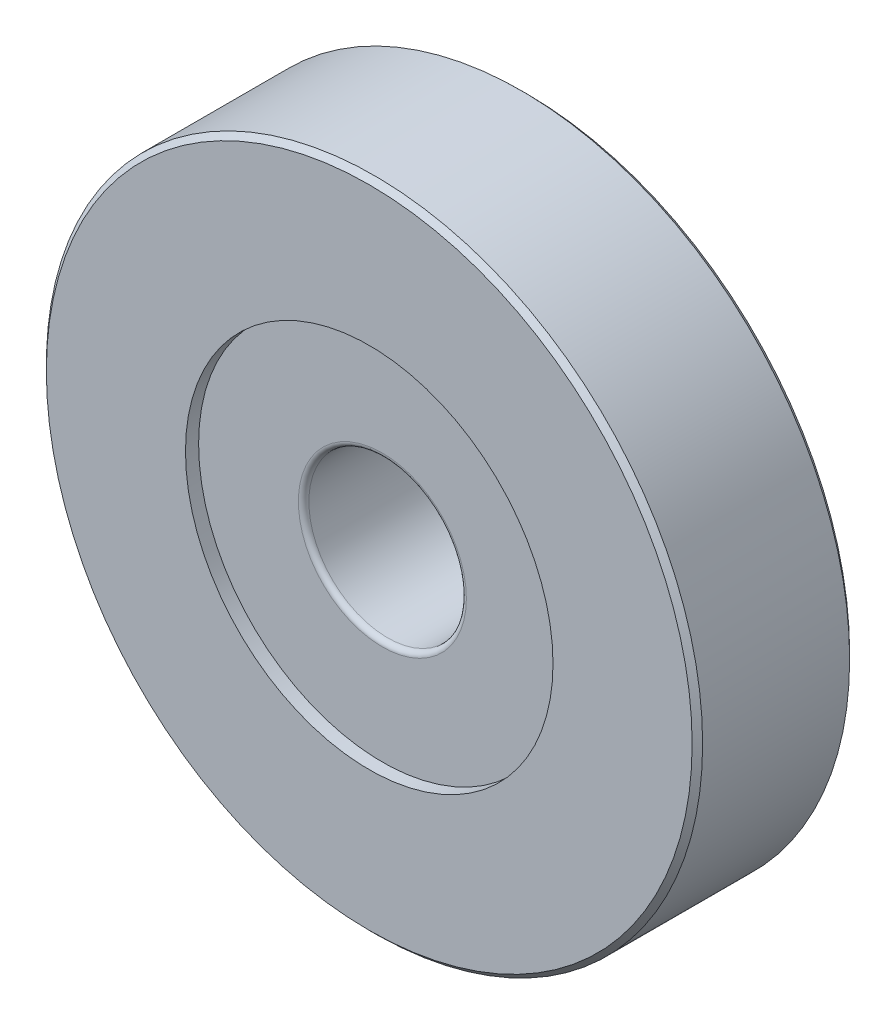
ISO-10303-21;
HEADER;
FILE_DESCRIPTION(('STEP AP214'),'2;1');
FILE_NAME('part.step','',(''),(''),'','','');
FILE_SCHEMA(('AUTOMOTIVE_DESIGN { 1 0 10303 214 1 1 1 1 }'));
ENDSEC;
DATA;
#1=APPLICATION_CONTEXT('core data for automotive mechanical design processes');
#2=APPLICATION_PROTOCOL_DEFINITION('international standard','automotive_design',2000,#1);
#3=PRODUCT_CONTEXT('',#1,'mechanical');
#4=PRODUCT('Part','Part','',(#3));
#5=PRODUCT_RELATED_PRODUCT_CATEGORY('part','',(#4));
#6=PRODUCT_DEFINITION_FORMATION('','',#4);
#7=PRODUCT_DEFINITION_CONTEXT('part definition',#1,'design');
#8=PRODUCT_DEFINITION('design','',#6,#7);
#9=PRODUCT_DEFINITION_SHAPE('','',#8);
#10=(LENGTH_UNIT() NAMED_UNIT(*) SI_UNIT(.MILLI.,.METRE.));
#11=(NAMED_UNIT(*) PLANE_ANGLE_UNIT() SI_UNIT($,.RADIAN.));
#12=(NAMED_UNIT(*) SI_UNIT($,.STERADIAN.) SOLID_ANGLE_UNIT());
#13=UNCERTAINTY_MEASURE_WITH_UNIT(LENGTH_MEASURE(1.E-05),#10,'distance_accuracy_value','');
#14=(GEOMETRIC_REPRESENTATION_CONTEXT(3) GLOBAL_UNCERTAINTY_ASSIGNED_CONTEXT((#13)) GLOBAL_UNIT_ASSIGNED_CONTEXT((#10,
#11,#12)) REPRESENTATION_CONTEXT('',''));
#15=CARTESIAN_POINT('',(0.,0.,0.));
#16=DIRECTION('',(0.,0.,1.));
#17=DIRECTION('',(1.,0.,0.));
#18=AXIS2_PLACEMENT_3D('',#15,#16,#17);
#19=CARTESIAN_POINT('',(0.,0.,2.30000000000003));
#20=DIRECTION('',(0.,0.,1.));
#21=DIRECTION('',(1.,0.,0.));
#22=AXIS2_PLACEMENT_3D('',#19,#20,#21);
#23=TOROIDAL_SURFACE('',#22,3.2,0.199999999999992);
#24=CARTESIAN_POINT('',(0.,0.,2.30000000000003));
#25=DIRECTION('',(0.,0.,1.));
#26=DIRECTION('',(1.,0.,0.));
#27=AXIS2_PLACEMENT_3D('',#24,#25,#26);
#28=CIRCLE('',#27,3.);
#29=CARTESIAN_POINT('',(3.,0.,2.30000000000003));
#30=VERTEX_POINT('',#29);
#31=EDGE_CURVE('E8',#30,#30,#28,.T.);
#32=ORIENTED_EDGE('',*,*,#31,.F.);
#33=EDGE_LOOP('',(#32));
#34=FACE_BOUND('',#33,.T.);
#35=CARTESIAN_POINT('',(0.,0.,2.5));
#36=DIRECTION('',(0.,0.,1.));
#37=DIRECTION('',(1.,0.,0.));
#38=AXIS2_PLACEMENT_3D('',#35,#36,#37);
#39=CIRCLE('',#38,3.2);
#40=CARTESIAN_POINT('',(3.2,0.,2.5));
#41=VERTEX_POINT('',#40);
#42=EDGE_CURVE('E52',#41,#41,#39,.T.);
#43=ORIENTED_EDGE('',*,*,#42,.T.);
#44=EDGE_LOOP('',(#43));
#45=FACE_BOUND('',#44,.T.);
#46=ADVANCED_FACE('F12',(#34,#45),#23,.T.);
#47=CARTESIAN_POINT('',(0.,0.,6.));
#48=DIRECTION('',(0.,0.,1.));
#49=DIRECTION('',(1.,0.,0.));
#50=AXIS2_PLACEMENT_3D('',#47,#48,#49);
#51=CYLINDRICAL_SURFACE('',#50,3.);
#52=CARTESIAN_POINT('',(0.,0.,-2.3));
#53=DIRECTION('',(0.,0.,1.));
#54=DIRECTION('',(1.,0.,0.));
#55=AXIS2_PLACEMENT_3D('',#52,#53,#54);
#56=CIRCLE('',#55,3.);
#57=CARTESIAN_POINT('',(3.,0.,-2.3));
#58=VERTEX_POINT('',#57);
#59=EDGE_CURVE('E18',#58,#58,#56,.T.);
#60=ORIENTED_EDGE('',*,*,#59,.F.);
#61=EDGE_LOOP('',(#60));
#62=FACE_BOUND('',#61,.T.);
#63=ORIENTED_EDGE('',*,*,#31,.T.);
#64=EDGE_LOOP('',(#63));
#65=FACE_BOUND('',#64,.T.);
#66=ADVANCED_FACE('F113',(#62,#65),#51,.F.);
#67=CARTESIAN_POINT('',(0.,0.,-2.3));
#68=DIRECTION('',(0.,0.,1.));
#69=DIRECTION('',(1.,0.,0.));
#70=AXIS2_PLACEMENT_3D('',#67,#68,#69);
#71=TOROIDAL_SURFACE('',#70,3.2,0.200000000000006);
#72=CARTESIAN_POINT('',(0.,0.,-2.5));
#73=DIRECTION('',(0.,0.,1.));
#74=DIRECTION('',(1.,0.,0.));
#75=AXIS2_PLACEMENT_3D('',#72,#73,#74);
#76=CIRCLE('',#75,3.2);
#77=CARTESIAN_POINT('',(3.2,0.,-2.5));
#78=VERTEX_POINT('',#77);
#79=EDGE_CURVE('E22',#78,#78,#76,.T.);
#80=ORIENTED_EDGE('',*,*,#79,.F.);
#81=EDGE_LOOP('',(#80));
#82=FACE_BOUND('',#81,.T.);
#83=ORIENTED_EDGE('',*,*,#59,.T.);
#84=EDGE_LOOP('',(#83));
#85=FACE_BOUND('',#84,.T.);
#86=ADVANCED_FACE('F108',(#82,#85),#71,.T.);
#87=CARTESIAN_POINT('',(0.,3.2,-2.5));
#88=DIRECTION('',(0.,0.,1.));
#89=DIRECTION('',(1.,0.,0.));
#90=AXIS2_PLACEMENT_3D('',#87,#88,#89);
#91=PLANE('',#90);
#92=CARTESIAN_POINT('',(0.,0.,-2.5));
#93=DIRECTION('',(0.,0.,1.));
#94=DIRECTION('',(1.,0.,0.));
#95=AXIS2_PLACEMENT_3D('',#92,#93,#94);
#96=CIRCLE('',#95,7.);
#97=CARTESIAN_POINT('',(7.,0.,-2.5));
#98=VERTEX_POINT('',#97);
#99=EDGE_CURVE('E26',#98,#98,#96,.T.);
#100=ORIENTED_EDGE('',*,*,#99,.F.);
#101=EDGE_LOOP('',(#100));
#102=FACE_BOUND('',#101,.T.);
#103=ORIENTED_EDGE('',*,*,#79,.T.);
#104=EDGE_LOOP('',(#103));
#105=FACE_BOUND('',#104,.T.);
#106=ADVANCED_FACE('F102',(#102,#105),#91,.F.);
#107=CARTESIAN_POINT('',(0.,0.,6.));
#108=DIRECTION('',(0.,0.,1.));
#109=DIRECTION('',(1.,0.,0.));
#110=AXIS2_PLACEMENT_3D('',#107,#108,#109);
#111=CYLINDRICAL_SURFACE('',#110,7.);
#112=CARTESIAN_POINT('',(0.,0.,-3.));
#113=DIRECTION('',(0.,0.,1.));
#114=DIRECTION('',(1.,0.,0.));
#115=AXIS2_PLACEMENT_3D('',#112,#113,#114);
#116=CIRCLE('',#115,7.);
#117=CARTESIAN_POINT('',(7.,0.,-3.));
#118=VERTEX_POINT('',#117);
#119=EDGE_CURVE('E31',#118,#118,#116,.T.);
#120=ORIENTED_EDGE('',*,*,#119,.F.);
#121=EDGE_LOOP('',(#120));
#122=FACE_BOUND('',#121,.T.);
#123=ORIENTED_EDGE('',*,*,#99,.T.);
#124=EDGE_LOOP('',(#123));
#125=FACE_BOUND('',#124,.T.);
#126=ADVANCED_FACE('F96',(#122,#125),#111,.F.);
#127=CARTESIAN_POINT('',(0.,12.3,-3.));
#128=DIRECTION('',(0.,0.,1.));
#129=DIRECTION('',(1.,0.,0.));
#130=AXIS2_PLACEMENT_3D('',#127,#128,#129);
#131=PLANE('',#130);
#132=CARTESIAN_POINT('',(0.,0.,-3.));
#133=DIRECTION('',(0.,0.,1.));
#134=DIRECTION('',(1.,0.,0.));
#135=AXIS2_PLACEMENT_3D('',#132,#133,#134);
#136=CIRCLE('',#135,12.3);
#137=CARTESIAN_POINT('',(12.3,0.,-3.));
#138=VERTEX_POINT('',#137);
#139=EDGE_CURVE('E34',#138,#138,#136,.T.);
#140=ORIENTED_EDGE('',*,*,#139,.F.);
#141=EDGE_LOOP('',(#140));
#142=FACE_BOUND('',#141,.T.);
#143=ORIENTED_EDGE('',*,*,#119,.T.);
#144=EDGE_LOOP('',(#143));
#145=FACE_BOUND('',#144,.T.);
#146=ADVANCED_FACE('F90',(#142,#145),#131,.F.);
#147=CARTESIAN_POINT('',(0.,0.,-3.));
#148=DIRECTION('',(0.,0.,1.));
#149=DIRECTION('',(1.,0.,0.));
#150=AXIS2_PLACEMENT_3D('',#147,#148,#149);
#151=CONICAL_SURFACE('',#150,12.3,0.785398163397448);
#152=CARTESIAN_POINT('',(0.,0.,-2.8));
#153=DIRECTION('',(0.,0.,1.));
#154=DIRECTION('',(1.,0.,0.));
#155=AXIS2_PLACEMENT_3D('',#152,#153,#154);
#156=CIRCLE('',#155,12.5);
#157=CARTESIAN_POINT('',(12.5,0.,-2.8));
#158=VERTEX_POINT('',#157);
#159=EDGE_CURVE('E37',#158,#158,#156,.T.);
#160=ORIENTED_EDGE('',*,*,#159,.F.);
#161=EDGE_LOOP('',(#160));
#162=FACE_BOUND('',#161,.T.);
#163=ORIENTED_EDGE('',*,*,#139,.T.);
#164=EDGE_LOOP('',(#163));
#165=FACE_BOUND('',#164,.T.);
#166=ADVANCED_FACE('F84',(#162,#165),#151,.T.);
#167=CARTESIAN_POINT('',(0.,0.,6.));
#168=DIRECTION('',(0.,0.,1.));
#169=DIRECTION('',(1.,0.,0.));
#170=AXIS2_PLACEMENT_3D('',#167,#168,#169);
#171=CYLINDRICAL_SURFACE('',#170,12.5);
#172=CARTESIAN_POINT('',(0.,0.,2.8));
#173=DIRECTION('',(0.,0.,1.));
#174=DIRECTION('',(1.,0.,0.));
#175=AXIS2_PLACEMENT_3D('',#172,#173,#174);
#176=CIRCLE('',#175,12.5);
#177=CARTESIAN_POINT('',(12.5,0.,2.8));
#178=VERTEX_POINT('',#177);
#179=EDGE_CURVE('E40',#178,#178,#176,.T.);
#180=ORIENTED_EDGE('',*,*,#179,.F.);
#181=EDGE_LOOP('',(#180));
#182=FACE_BOUND('',#181,.T.);
#183=ORIENTED_EDGE('',*,*,#159,.T.);
#184=EDGE_LOOP('',(#183));
#185=FACE_BOUND('',#184,.T.);
#186=ADVANCED_FACE('F78',(#182,#185),#171,.T.);
#187=CARTESIAN_POINT('',(0.,0.,2.8));
#188=DIRECTION('',(0.,0.,-1.));
#189=DIRECTION('',(-1.,0.,0.));
#190=AXIS2_PLACEMENT_3D('',#187,#188,#189);
#191=CONICAL_SURFACE('',#190,12.5,0.785398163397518);
#192=CARTESIAN_POINT('',(0.,0.,3.));
#193=DIRECTION('',(0.,0.,1.));
#194=DIRECTION('',(1.,0.,0.));
#195=AXIS2_PLACEMENT_3D('',#192,#193,#194);
#196=CIRCLE('',#195,12.3);
#197=CARTESIAN_POINT('',(12.3,0.,3.));
#198=VERTEX_POINT('',#197);
#199=EDGE_CURVE('E43',#198,#198,#196,.T.);
#200=ORIENTED_EDGE('',*,*,#199,.F.);
#201=EDGE_LOOP('',(#200));
#202=FACE_BOUND('',#201,.T.);
#203=ORIENTED_EDGE('',*,*,#179,.T.);
#204=EDGE_LOOP('',(#203));
#205=FACE_BOUND('',#204,.T.);
#206=ADVANCED_FACE('F72',(#202,#205),#191,.T.);
#207=CARTESIAN_POINT('',(0.,12.3,3.));
#208=DIRECTION('',(0.,0.,-1.));
#209=DIRECTION('',(-1.,0.,0.));
#210=AXIS2_PLACEMENT_3D('',#207,#208,#209);
#211=PLANE('',#210);
#212=CARTESIAN_POINT('',(0.,0.,3.));
#213=DIRECTION('',(0.,0.,1.));
#214=DIRECTION('',(1.,0.,0.));
#215=AXIS2_PLACEMENT_3D('',#212,#213,#214);
#216=CIRCLE('',#215,7.);
#217=CARTESIAN_POINT('',(7.,0.,3.));
#218=VERTEX_POINT('',#217);
#219=EDGE_CURVE('E46',#218,#218,#216,.T.);
#220=ORIENTED_EDGE('',*,*,#219,.F.);
#221=EDGE_LOOP('',(#220));
#222=FACE_BOUND('',#221,.T.);
#223=ORIENTED_EDGE('',*,*,#199,.T.);
#224=EDGE_LOOP('',(#223));
#225=FACE_BOUND('',#224,.T.);
#226=ADVANCED_FACE('F66',(#222,#225),#211,.F.);
#227=CARTESIAN_POINT('',(0.,0.,6.));
#228=DIRECTION('',(0.,0.,1.));
#229=DIRECTION('',(1.,0.,0.));
#230=AXIS2_PLACEMENT_3D('',#227,#228,#229);
#231=CYLINDRICAL_SURFACE('',#230,7.);
#232=CARTESIAN_POINT('',(0.,0.,2.5));
#233=DIRECTION('',(0.,0.,1.));
#234=DIRECTION('',(1.,0.,0.));
#235=AXIS2_PLACEMENT_3D('',#232,#233,#234);
#236=CIRCLE('',#235,7.);
#237=CARTESIAN_POINT('',(7.,0.,2.5));
#238=VERTEX_POINT('',#237);
#239=EDGE_CURVE('E49',#238,#238,#236,.T.);
#240=ORIENTED_EDGE('',*,*,#239,.F.);
#241=EDGE_LOOP('',(#240));
#242=FACE_BOUND('',#241,.T.);
#243=ORIENTED_EDGE('',*,*,#219,.T.);
#244=EDGE_LOOP('',(#243));
#245=FACE_BOUND('',#244,.T.);
#246=ADVANCED_FACE('F60',(#242,#245),#231,.F.);
#247=CARTESIAN_POINT('',(0.,3.2,2.5));
#248=DIRECTION('',(0.,0.,-1.));
#249=DIRECTION('',(-1.,0.,0.));
#250=AXIS2_PLACEMENT_3D('',#247,#248,#249);
#251=PLANE('',#250);
#252=ORIENTED_EDGE('',*,*,#42,.F.);
#253=EDGE_LOOP('',(#252));
#254=FACE_BOUND('',#253,.T.);
#255=ORIENTED_EDGE('',*,*,#239,.T.);
#256=EDGE_LOOP('',(#255));
#257=FACE_BOUND('',#256,.T.);
#258=ADVANCED_FACE('F57',(#254,#257),#251,.F.);
#259=CLOSED_SHELL('',(#46,#66,#86,#106,#126,#146,#166,#186,#206,#226,#246,#258));
#260=MANIFOLD_SOLID_BREP('B1',#259);
#261=ADVANCED_BREP_SHAPE_REPRESENTATION('',(#18,#260),#14);
#262=SHAPE_DEFINITION_REPRESENTATION(#9,#261);
ENDSEC;
END-ISO-10303-21;
